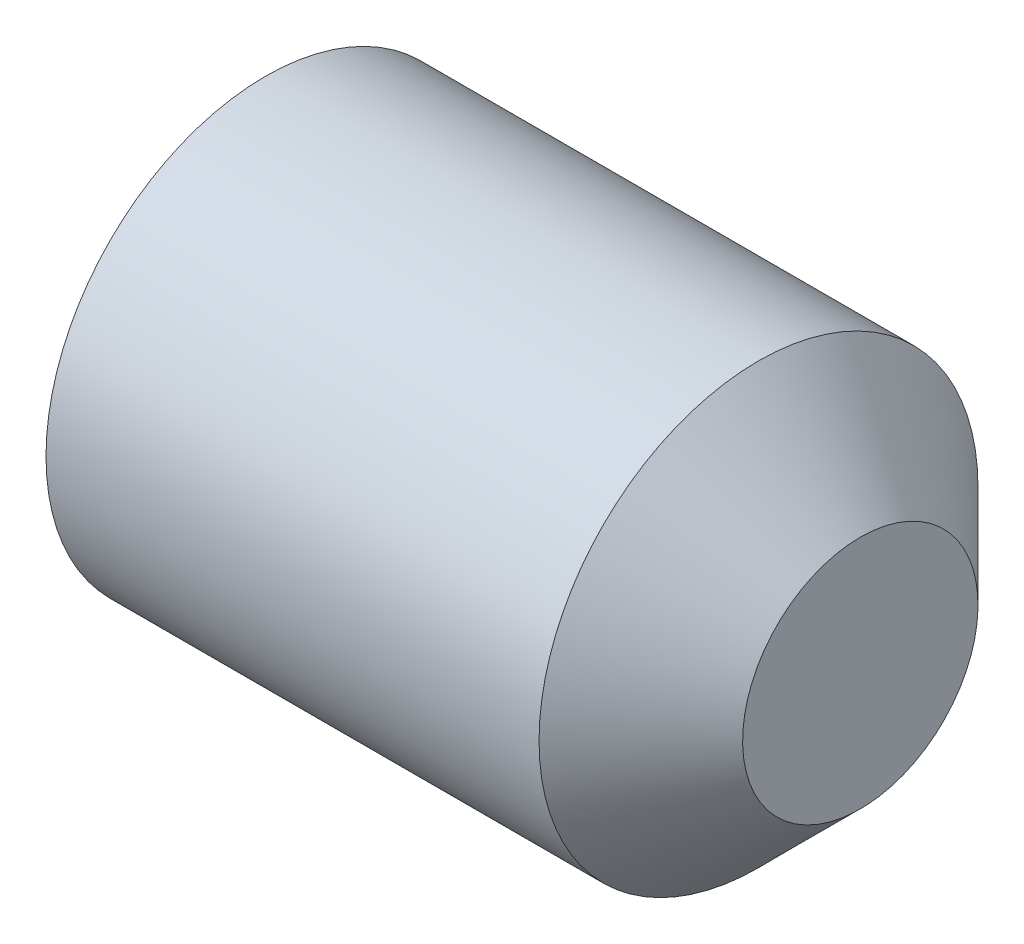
ISO-10303-21;
HEADER;
FILE_DESCRIPTION(('STEP AP214'),'2;1');
FILE_NAME('part.step','',(''),(''),'','','');
FILE_SCHEMA(('AUTOMOTIVE_DESIGN { 1 0 10303 214 1 1 1 1 }'));
ENDSEC;
DATA;
#1=APPLICATION_CONTEXT('core data for automotive mechanical design processes');
#2=APPLICATION_PROTOCOL_DEFINITION('international standard','automotive_design',2000,#1);
#3=PRODUCT_CONTEXT('',#1,'mechanical');
#4=PRODUCT('Part','Part','',(#3));
#5=PRODUCT_RELATED_PRODUCT_CATEGORY('part','',(#4));
#6=PRODUCT_DEFINITION_FORMATION('','',#4);
#7=PRODUCT_DEFINITION_CONTEXT('part definition',#1,'design');
#8=PRODUCT_DEFINITION('design','',#6,#7);
#9=PRODUCT_DEFINITION_SHAPE('','',#8);
#10=(LENGTH_UNIT() NAMED_UNIT(*) SI_UNIT(.MILLI.,.METRE.));
#11=(NAMED_UNIT(*) PLANE_ANGLE_UNIT() SI_UNIT($,.RADIAN.));
#12=(NAMED_UNIT(*) SI_UNIT($,.STERADIAN.) SOLID_ANGLE_UNIT());
#13=UNCERTAINTY_MEASURE_WITH_UNIT(LENGTH_MEASURE(1.E-05),#10,'distance_accuracy_value','');
#14=(GEOMETRIC_REPRESENTATION_CONTEXT(3) GLOBAL_UNCERTAINTY_ASSIGNED_CONTEXT((#13)) GLOBAL_UNIT_ASSIGNED_CONTEXT((#10,
#11,#12)) REPRESENTATION_CONTEXT('',''));
#15=CARTESIAN_POINT('',(0.,0.,0.));
#16=DIRECTION('',(0.,0.,1.));
#17=DIRECTION('',(1.,0.,0.));
#18=AXIS2_PLACEMENT_3D('',#15,#16,#17);
#19=CARTESIAN_POINT('',(0.,1.7526,0.));
#20=DIRECTION('',(-1.,0.,0.));
#21=DIRECTION('',(0.,-1.,0.));
#22=AXIS2_PLACEMENT_3D('',#19,#20,#21);
#23=PLANE('',#22);
#24=DIRECTION('',(0.,0.709496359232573,0.70470910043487));
#25=VECTOR('',#24,1.);
#26=CARTESIAN_POINT('',(0.,-0.891581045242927,0.242136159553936));
#27=LINE('',#26,#25);
#28=CARTESIAN_POINT('',(0.,-0.891581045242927,0.242136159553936));
#29=VERTEX_POINT('',#28);
#30=CARTESIAN_POINT('',(0.,-0.236094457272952,0.893199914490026));
#31=VERTEX_POINT('',#30);
#32=EDGE_CURVE('E395',#29,#31,#27,.T.);
#33=ORIENTED_EDGE('',*,*,#32,.F.);
#34=DIRECTION('',(0.,-0.255547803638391,0.966796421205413));
#35=VECTOR('',#34,1.);
#36=CARTESIAN_POINT('',(0.,-0.655486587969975,-0.651063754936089));
#37=LINE('',#36,#35);
#38=CARTESIAN_POINT('',(0.,-0.655486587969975,-0.651063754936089));
#39=VERTEX_POINT('',#38);
#40=EDGE_CURVE('E464',#39,#29,#37,.T.);
#41=ORIENTED_EDGE('',*,*,#40,.F.);
#42=DIRECTION('',(0.,-0.965044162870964,0.262087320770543));
#43=VECTOR('',#42,1.);
#44=CARTESIAN_POINT('',(0.,0.236094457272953,-0.893199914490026));
#45=LINE('',#44,#43);
#46=CARTESIAN_POINT('',(0.,0.236094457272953,-0.893199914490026));
#47=VERTEX_POINT('',#46);
#48=EDGE_CURVE('E458',#47,#39,#45,.T.);
#49=ORIENTED_EDGE('',*,*,#48,.F.);
#50=DIRECTION('',(0.,-0.709496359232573,-0.70470910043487));
#51=VECTOR('',#50,1.);
#52=CARTESIAN_POINT('',(0.,0.891581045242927,-0.242136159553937));
#53=LINE('',#52,#51);
#54=CARTESIAN_POINT('',(0.,0.891581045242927,-0.242136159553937));
#55=VERTEX_POINT('',#54);
#56=EDGE_CURVE('E456',#55,#47,#53,.T.);
#57=ORIENTED_EDGE('',*,*,#56,.F.);
#58=DIRECTION('',(0.,0.255547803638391,-0.966796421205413));
#59=VECTOR('',#58,1.);
#60=CARTESIAN_POINT('',(0.,0.655486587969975,0.651063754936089));
#61=LINE('',#60,#59);
#62=CARTESIAN_POINT('',(0.,0.655486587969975,0.651063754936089));
#63=VERTEX_POINT('',#62);
#64=EDGE_CURVE('E438',#63,#55,#61,.T.);
#65=ORIENTED_EDGE('',*,*,#64,.F.);
#66=DIRECTION('',(0.,0.965044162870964,-0.262087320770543));
#67=VECTOR('',#66,1.);
#68=CARTESIAN_POINT('',(0.,-0.236094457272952,0.893199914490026));
#69=LINE('',#68,#67);
#70=EDGE_CURVE('E449',#31,#63,#69,.T.);
#71=ORIENTED_EDGE('',*,*,#70,.F.);
#72=EDGE_LOOP('',(#33,#41,#49,#57,#65,#71));
#73=FACE_BOUND('',#72,.T.);
#74=CARTESIAN_POINT('',(0.,0.,0.));
#75=DIRECTION('',(1.,0.,0.));
#76=DIRECTION('',(0.,1.,0.));
#77=AXIS2_PLACEMENT_3D('',#74,#75,#76);
#78=CIRCLE('',#77,1.7526);
#79=CARTESIAN_POINT('',(0.,1.7526,0.));
#80=VERTEX_POINT('',#79);
#81=EDGE_CURVE('E11',#80,#80,#78,.T.);
#82=ORIENTED_EDGE('',*,*,#81,.F.);
#83=EDGE_LOOP('',(#82));
#84=FACE_BOUND('',#83,.T.);
#85=ADVANCED_FACE('F381',(#73,#84),#23,.T.);
#86=CARTESIAN_POINT('',(4.7498,0.,0.));
#87=DIRECTION('',(1.,0.,0.));
#88=DIRECTION('',(0.,1.,0.));
#89=AXIS2_PLACEMENT_3D('',#86,#87,#88);
#90=CYLINDRICAL_SURFACE('',#89,1.7526);
#91=ORIENTED_EDGE('',*,*,#81,.T.);
#92=EDGE_LOOP('',(#91));
#93=FACE_BOUND('',#92,.T.);
#94=CARTESIAN_POINT('',(3.937,0.,0.));
#95=DIRECTION('',(1.,0.,0.));
#96=DIRECTION('',(0.,1.,0.));
#97=AXIS2_PLACEMENT_3D('',#94,#95,#96);
#98=CIRCLE('',#97,1.7526);
#99=CARTESIAN_POINT('',(3.937,1.7526,0.));
#100=VERTEX_POINT('',#99);
#101=EDGE_CURVE('E388',#100,#100,#98,.T.);
#102=ORIENTED_EDGE('',*,*,#101,.F.);
#103=EDGE_LOOP('',(#102));
#104=FACE_BOUND('',#103,.T.);
#105=ADVANCED_FACE('F496',(#93,#104),#90,.T.);
#106=CARTESIAN_POINT('',(4.7498,0.,0.));
#107=DIRECTION('',(-1.,0.,0.));
#108=DIRECTION('',(0.,-1.,0.));
#109=AXIS2_PLACEMENT_3D('',#106,#107,#108);
#110=CONICAL_SURFACE('',#109,0.939800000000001,0.785398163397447);
#111=ORIENTED_EDGE('',*,*,#101,.T.);
#112=EDGE_LOOP('',(#111));
#113=FACE_BOUND('',#112,.T.);
#114=CARTESIAN_POINT('',(4.7498,0.,0.));
#115=DIRECTION('',(1.,0.,0.));
#116=DIRECTION('',(0.,1.,0.));
#117=AXIS2_PLACEMENT_3D('',#114,#115,#116);
#118=CIRCLE('',#117,0.939800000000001);
#119=CARTESIAN_POINT('',(4.7498,0.9398,0.));
#120=VERTEX_POINT('',#119);
#121=EDGE_CURVE('E482',#120,#120,#118,.T.);
#122=ORIENTED_EDGE('',*,*,#121,.F.);
#123=EDGE_LOOP('',(#122));
#124=FACE_BOUND('',#123,.T.);
#125=ADVANCED_FACE('F493',(#113,#124),#110,.T.);
#126=CARTESIAN_POINT('',(4.7498,0.9398,0.));
#127=DIRECTION('',(1.,0.,0.));
#128=DIRECTION('',(0.,1.,0.));
#129=AXIS2_PLACEMENT_3D('',#126,#127,#128);
#130=PLANE('',#129);
#131=ORIENTED_EDGE('',*,*,#121,.T.);
#132=EDGE_LOOP('',(#131));
#133=FACE_BOUND('',#132,.T.);
#134=ADVANCED_FACE('F502',(#133),#130,.T.);
#135=CARTESIAN_POINT('',(1.905,-0.891581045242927,0.242136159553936));
#136=DIRECTION('',(0.,-0.70470910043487,0.709496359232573));
#137=DIRECTION('',(0.,-0.709496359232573,-0.70470910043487));
#138=AXIS2_PLACEMENT_3D('',#135,#136,#137);
#139=PLANE('',#138);
#140=ORIENTED_EDGE('',*,*,#32,.T.);
#141=DIRECTION('',(-1.,0.,0.));
#142=VECTOR('',#141,1.);
#143=CARTESIAN_POINT('',(1.905,-0.236094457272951,0.893199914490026));
#144=LINE('',#143,#142);
#145=CARTESIAN_POINT('',(1.905,-0.236094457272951,0.893199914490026));
#146=VERTEX_POINT('',#145);
#147=EDGE_CURVE('E446',#146,#31,#144,.T.);
#148=ORIENTED_EDGE('',*,*,#147,.F.);
#149=DIRECTION('',(0.,0.709496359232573,0.70470910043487));
#150=VECTOR('',#149,1.);
#151=CARTESIAN_POINT('',(1.905,-0.891581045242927,0.242136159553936));
#152=LINE('',#151,#150);
#153=CARTESIAN_POINT('',(1.905,-0.891581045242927,0.242136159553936));
#154=VERTEX_POINT('',#153);
#155=EDGE_CURVE('E466',#154,#146,#152,.T.);
#156=ORIENTED_EDGE('',*,*,#155,.F.);
#157=DIRECTION('',(-1.,0.,0.));
#158=VECTOR('',#157,1.);
#159=CARTESIAN_POINT('',(1.905,-0.891581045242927,0.242136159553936));
#160=LINE('',#159,#158);
#161=EDGE_CURVE('E402',#154,#29,#160,.T.);
#162=ORIENTED_EDGE('',*,*,#161,.T.);
#163=EDGE_LOOP('',(#140,#148,#156,#162));
#164=FACE_BOUND('',#163,.T.);
#165=ADVANCED_FACE('F508',(#164),#139,.F.);
#166=CARTESIAN_POINT('',(1.905,-0.655486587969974,-0.651063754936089));
#167=DIRECTION('',(0.,-0.966796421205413,-0.255547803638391));
#168=DIRECTION('',(0.,0.255547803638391,-0.966796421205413));
#169=AXIS2_PLACEMENT_3D('',#166,#167,#168);
#170=PLANE('',#169);
#171=ORIENTED_EDGE('',*,*,#40,.T.);
#172=ORIENTED_EDGE('',*,*,#161,.F.);
#173=DIRECTION('',(0.,-0.255547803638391,0.966796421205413));
#174=VECTOR('',#173,1.);
#175=CARTESIAN_POINT('',(1.905,-0.655486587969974,-0.651063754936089));
#176=LINE('',#175,#174);
#177=CARTESIAN_POINT('',(1.905,-0.655486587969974,-0.651063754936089));
#178=VERTEX_POINT('',#177);
#179=EDGE_CURVE('E478',#178,#154,#176,.T.);
#180=ORIENTED_EDGE('',*,*,#179,.F.);
#181=DIRECTION('',(-1.,0.,0.));
#182=VECTOR('',#181,1.);
#183=CARTESIAN_POINT('',(1.905,-0.655486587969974,-0.651063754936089));
#184=LINE('',#183,#182);
#185=EDGE_CURVE('E483',#178,#39,#184,.T.);
#186=ORIENTED_EDGE('',*,*,#185,.T.);
#187=EDGE_LOOP('',(#171,#172,#180,#186));
#188=FACE_BOUND('',#187,.T.);
#189=ADVANCED_FACE('F512',(#188),#170,.F.);
#190=CARTESIAN_POINT('',(1.905,0.236094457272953,-0.893199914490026));
#191=DIRECTION('',(0.,-0.262087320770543,-0.965044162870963));
#192=DIRECTION('',(0.,0.965044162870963,-0.262087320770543));
#193=AXIS2_PLACEMENT_3D('',#190,#191,#192);
#194=PLANE('',#193);
#195=ORIENTED_EDGE('',*,*,#48,.T.);
#196=ORIENTED_EDGE('',*,*,#185,.F.);
#197=DIRECTION('',(0.,-0.965044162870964,0.262087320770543));
#198=VECTOR('',#197,1.);
#199=CARTESIAN_POINT('',(1.905,0.236094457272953,-0.893199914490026));
#200=LINE('',#199,#198);
#201=CARTESIAN_POINT('',(1.905,0.236094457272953,-0.893199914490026));
#202=VERTEX_POINT('',#201);
#203=EDGE_CURVE('E475',#202,#178,#200,.T.);
#204=ORIENTED_EDGE('',*,*,#203,.F.);
#205=DIRECTION('',(-1.,0.,0.));
#206=VECTOR('',#205,1.);
#207=CARTESIAN_POINT('',(1.905,0.236094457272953,-0.893199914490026));
#208=LINE('',#207,#206);
#209=EDGE_CURVE('E485',#202,#47,#208,.T.);
#210=ORIENTED_EDGE('',*,*,#209,.T.);
#211=EDGE_LOOP('',(#195,#196,#204,#210));
#212=FACE_BOUND('',#211,.T.);
#213=ADVANCED_FACE('F521',(#212),#194,.F.);
#214=CARTESIAN_POINT('',(1.905,0.891581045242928,-0.242136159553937));
#215=DIRECTION('',(0.,0.70470910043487,-0.709496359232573));
#216=DIRECTION('',(0.,0.709496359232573,0.70470910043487));
#217=AXIS2_PLACEMENT_3D('',#214,#215,#216);
#218=PLANE('',#217);
#219=ORIENTED_EDGE('',*,*,#56,.T.);
#220=ORIENTED_EDGE('',*,*,#209,.F.);
#221=DIRECTION('',(0.,-0.709496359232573,-0.70470910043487));
#222=VECTOR('',#221,1.);
#223=CARTESIAN_POINT('',(1.905,0.891581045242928,-0.242136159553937));
#224=LINE('',#223,#222);
#225=CARTESIAN_POINT('',(1.905,0.891581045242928,-0.242136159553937));
#226=VERTEX_POINT('',#225);
#227=EDGE_CURVE('E472',#226,#202,#224,.T.);
#228=ORIENTED_EDGE('',*,*,#227,.F.);
#229=DIRECTION('',(-1.,0.,0.));
#230=VECTOR('',#229,1.);
#231=CARTESIAN_POINT('',(1.905,0.891581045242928,-0.242136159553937));
#232=LINE('',#231,#230);
#233=EDGE_CURVE('E445',#226,#55,#232,.T.);
#234=ORIENTED_EDGE('',*,*,#233,.T.);
#235=EDGE_LOOP('',(#219,#220,#228,#234));
#236=FACE_BOUND('',#235,.T.);
#237=ADVANCED_FACE('F518',(#236),#218,.F.);
#238=CARTESIAN_POINT('',(1.905,0.655486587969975,0.651063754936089));
#239=DIRECTION('',(0.,0.966796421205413,0.255547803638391));
#240=DIRECTION('',(0.,-0.255547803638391,0.966796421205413));
#241=AXIS2_PLACEMENT_3D('',#238,#239,#240);
#242=PLANE('',#241);
#243=ORIENTED_EDGE('',*,*,#64,.T.);
#244=ORIENTED_EDGE('',*,*,#233,.F.);
#245=DIRECTION('',(0.,0.255547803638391,-0.966796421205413));
#246=VECTOR('',#245,1.);
#247=CARTESIAN_POINT('',(1.905,0.655486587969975,0.651063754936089));
#248=LINE('',#247,#246);
#249=CARTESIAN_POINT('',(1.905,0.655486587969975,0.651063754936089));
#250=VERTEX_POINT('',#249);
#251=EDGE_CURVE('E441',#250,#226,#248,.T.);
#252=ORIENTED_EDGE('',*,*,#251,.F.);
#253=DIRECTION('',(-1.,0.,0.));
#254=VECTOR('',#253,1.);
#255=CARTESIAN_POINT('',(1.905,0.655486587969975,0.651063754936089));
#256=LINE('',#255,#254);
#257=EDGE_CURVE('E434',#250,#63,#256,.T.);
#258=ORIENTED_EDGE('',*,*,#257,.T.);
#259=EDGE_LOOP('',(#243,#244,#252,#258));
#260=FACE_BOUND('',#259,.T.);
#261=ADVANCED_FACE('F436',(#260),#242,.F.);
#262=CARTESIAN_POINT('',(1.905,-0.236094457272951,0.893199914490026));
#263=DIRECTION('',(0.,0.262087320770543,0.965044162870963));
#264=DIRECTION('',(0.,-0.965044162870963,0.262087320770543));
#265=AXIS2_PLACEMENT_3D('',#262,#263,#264);
#266=PLANE('',#265);
#267=ORIENTED_EDGE('',*,*,#70,.T.);
#268=ORIENTED_EDGE('',*,*,#257,.F.);
#269=DIRECTION('',(0.,0.965044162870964,-0.262087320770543));
#270=VECTOR('',#269,1.);
#271=CARTESIAN_POINT('',(1.905,-0.236094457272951,0.893199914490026));
#272=LINE('',#271,#270);
#273=EDGE_CURVE('E469',#146,#250,#272,.T.);
#274=ORIENTED_EDGE('',*,*,#273,.F.);
#275=ORIENTED_EDGE('',*,*,#147,.T.);
#276=EDGE_LOOP('',(#267,#268,#274,#275));
#277=FACE_BOUND('',#276,.T.);
#278=ADVANCED_FACE('F450',(#277),#266,.F.);
#279=CARTESIAN_POINT('',(1.905,-0.891581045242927,0.242136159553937));
#280=DIRECTION('',(1.,0.,0.));
#281=DIRECTION('',(0.,1.,0.));
#282=AXIS2_PLACEMENT_3D('',#279,#280,#281);
#283=PLANE('',#282);
#284=ORIENTED_EDGE('',*,*,#155,.T.);
#285=ORIENTED_EDGE('',*,*,#273,.T.);
#286=ORIENTED_EDGE('',*,*,#251,.T.);
#287=ORIENTED_EDGE('',*,*,#227,.T.);
#288=ORIENTED_EDGE('',*,*,#203,.T.);
#289=ORIENTED_EDGE('',*,*,#179,.T.);
#290=EDGE_LOOP('',(#284,#285,#286,#287,#288,#289));
#291=FACE_BOUND('',#290,.T.);
#292=ADVANCED_FACE('F515',(#291),#283,.F.);
#293=CLOSED_SHELL('',(#85,#105,#125,#134,#165,#189,#213,#237,#261,#278,#292));
#294=MANIFOLD_SOLID_BREP('B2',#293);
#295=ADVANCED_BREP_SHAPE_REPRESENTATION('',(#18,#294),#14);
#296=SHAPE_DEFINITION_REPRESENTATION(#9,#295);
ENDSEC;
END-ISO-10303-21;
